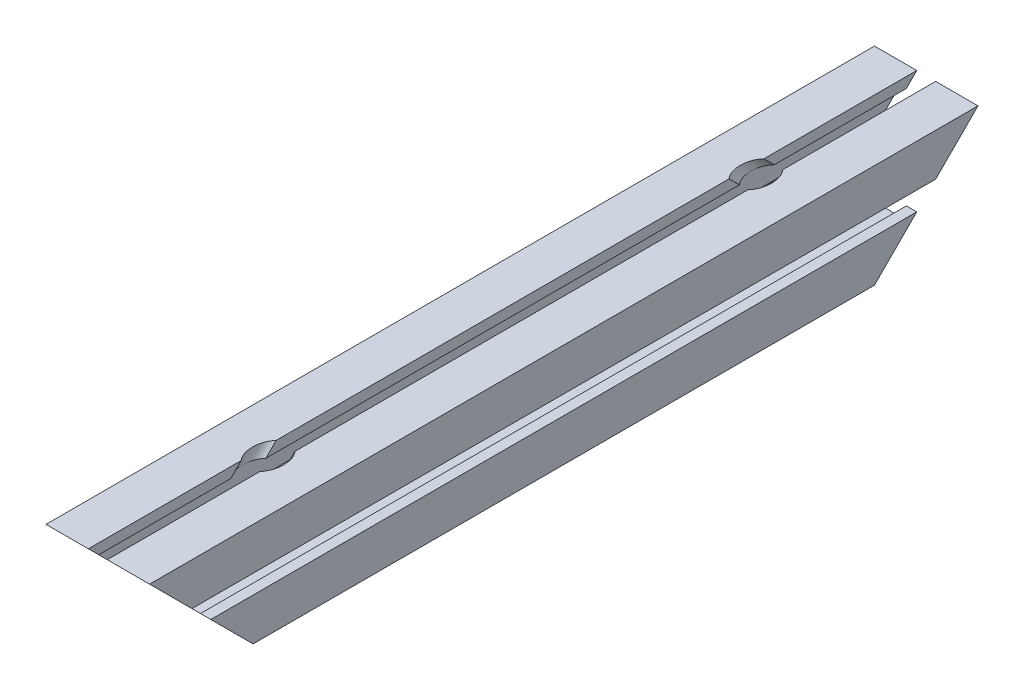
from build123d import *

# Parameters (mm, degrees)
EXTRUDE1_DEPTH      = 180
EXTRUDE1_DEPTH_BACK = 180
SKETCH1_R           = 6
SKETCH1_R_2         = 3.75
EXTRUDE2_DEPTH      = 187.899036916
SKETCH3_R           = 4.25
EXTRUDE3_DEPTH      = 279.764013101
SKETCH4_R           = 6.75
SKETCH4_R_2         = 4.25
EXTRUDE4_DEPTH      = 260.198128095


with BuildPart() as part:
    # Sketch1 → Extrude1 (new, two sides: drawn at the far end of the back side and taken through both)
    with BuildSketch(Plane.XY.offset(-EXTRUDE1_DEPTH_BACK)):
        Polygon((-18, -4.1), (-22.5, -4.1), (-22.5, -22.5), (-4.1, -22.5), (-4.1, -18), (-6.8, -18), (-6.8, -9.5), (-4.5, -7.2), (4.5, -7.2), (6.8, -9.5), (6.8, -18), (4.1, -18), (4.1, -22.5), (22.5, -22.5), (22.5, -4.1), (18, -4.1), (18, -6.8), (9.5, -6.8), (7.2, -4.5), (7.2, 4.5), (9.5, 6.8), (18, 6.8), (18, 4.1), (22.5, 4.1), (22.5, 22.5), (4.1, 22.5), (4.1, 18), (6.8, 18), (6.8, 9.5), (4.5, 7.2), (-4.5, 7.2), (-6.8, 9.5), (-6.8, 18), (-4.1, 18), (-4.1, 22.5), (-22.5, 22.5), (-22.5, 4.1), (-18, 4.1), (-18, 6.8), (-9.5, 6.8), (-7.2, 4.5), (-7.2, -4.5), (-9.5, -6.8), (-18, -6.8), align=None)
        with Locations((14.65, -14.65)):
            Circle(SKETCH1_R, mode=Mode.SUBTRACT)
        with Locations((-14.65, -14.65)):
            Circle(SKETCH1_R, mode=Mode.SUBTRACT)
        Circle(SKETCH1_R_2, mode=Mode.SUBTRACT)
        with Locations((14.65, 14.65)):
            Circle(SKETCH1_R, mode=Mode.SUBTRACT)
        with Locations((-14.65, 14.65)):
            Circle(SKETCH1_R, mode=Mode.SUBTRACT)
    extrude(amount=EXTRUDE1_DEPTH + EXTRUDE1_DEPTH_BACK)

    # Sketch2 → Extrude2 (cut, through all)
    with BuildSketch(Plane(origin=(22.5, 0, 0), x_dir=(0, 0, -1), z_dir=(1, 0, 0))):
        Polygon((-161.6, 4.1), (-180, 4.1), (-180, -22.5), (-135, -22.5), align=None)
        Polygon((-180, 22.5), (-180, 4.1), (-161.6, 4.1), align=None)
        Polygon((180, 4.1), (161.6, 4.1), (135, -22.5), (180, -22.5), align=None)
        Polygon((180, 22.5), (161.6, 4.1), (180, 4.1), align=None)
    extrude(amount=-EXTRUDE2_DEPTH, mode=Mode.SUBTRACT)

    # Sketch3 → Extrude3 (cut, through all)
    with BuildSketch(Plane(origin=(0, -78.75, 78.75), x_dir=(1, 0, 0), z_dir=(0, -0.707106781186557, 0.7071067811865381))):
        with Locations(Location((0, 90.86512319, 0), (0, 0, 90))):
            Circle(SKETCH3_R)
    extrude3 = extrude(amount=-EXTRUDE3_DEPTH, mode=Mode.SUBTRACT)

    # Sketch4 → Extrude4 (cut, through all)
    with BuildSketch(Plane(origin=(0, -63.483564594, 63.483564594), x_dir=(1, 0, 0), z_dir=(0, -0.707106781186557, 0.7071067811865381))):
        with Locations(Location((0, 90.86512319, 0), (0, 0, 270))):
            Circle(SKETCH4_R)
        with Locations(Location((0, 90.86512319, 0), (0, 0, 329.881821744))):
            Circle(SKETCH4_R_2, mode=Mode.SUBTRACT)
    extrude4 = extrude(amount=-EXTRUDE4_DEPTH, mode=Mode.SUBTRACT)

    # Mirror1: Extrude3, Extrude4 across plane
    add(extrude3.mirror(Plane.XY), mode=Mode.SUBTRACT)
    add(extrude4.mirror(Plane.XY), mode=Mode.SUBTRACT)


solid = part.part
